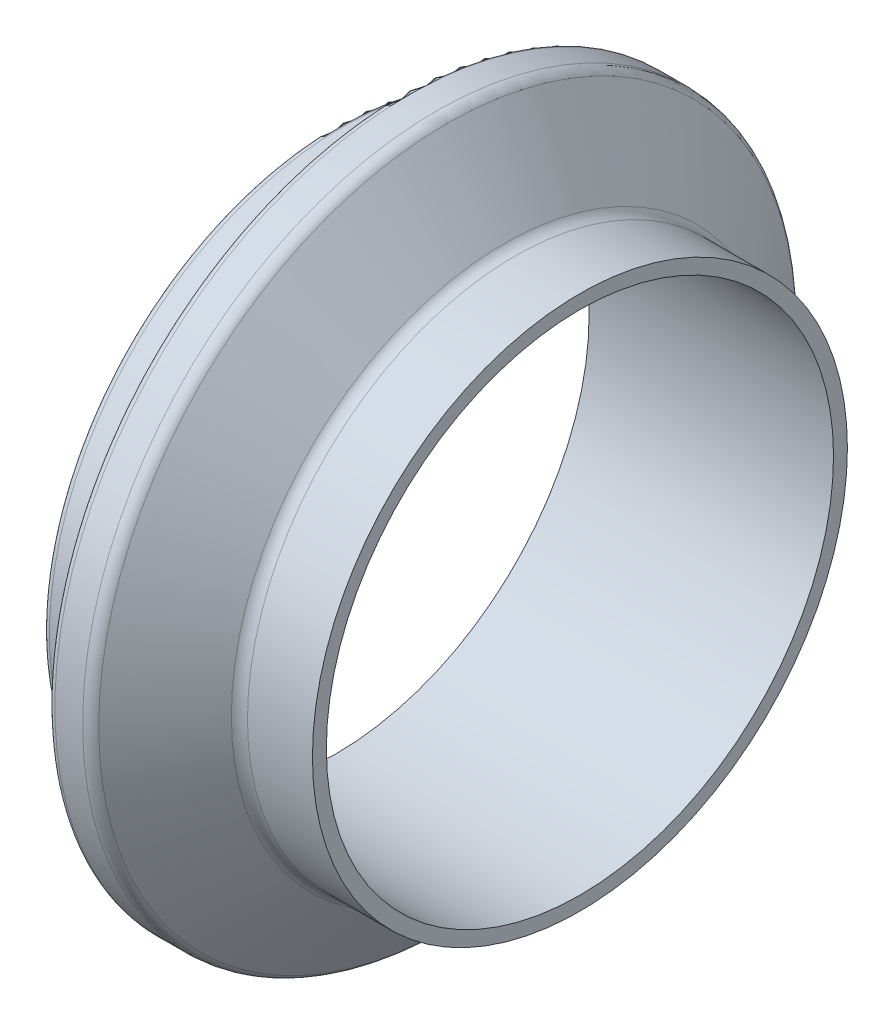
ISO-10303-21;
HEADER;
FILE_DESCRIPTION(('STEP AP214'),'2;1');
FILE_NAME('part.step','',(''),(''),'','','');
FILE_SCHEMA(('AUTOMOTIVE_DESIGN { 1 0 10303 214 1 1 1 1 }'));
ENDSEC;
DATA;
#1=APPLICATION_CONTEXT('core data for automotive mechanical design processes');
#2=APPLICATION_PROTOCOL_DEFINITION('international standard','automotive_design',2000,#1);
#3=PRODUCT_CONTEXT('',#1,'mechanical');
#4=PRODUCT('Part','Part','',(#3));
#5=PRODUCT_RELATED_PRODUCT_CATEGORY('part','',(#4));
#6=PRODUCT_DEFINITION_FORMATION('','',#4);
#7=PRODUCT_DEFINITION_CONTEXT('part definition',#1,'design');
#8=PRODUCT_DEFINITION('design','',#6,#7);
#9=PRODUCT_DEFINITION_SHAPE('','',#8);
#10=(LENGTH_UNIT() NAMED_UNIT(*) SI_UNIT(.MILLI.,.METRE.));
#11=(NAMED_UNIT(*) PLANE_ANGLE_UNIT() SI_UNIT($,.RADIAN.));
#12=(NAMED_UNIT(*) SI_UNIT($,.STERADIAN.) SOLID_ANGLE_UNIT());
#13=UNCERTAINTY_MEASURE_WITH_UNIT(LENGTH_MEASURE(1.E-05),#10,'distance_accuracy_value','');
#14=(GEOMETRIC_REPRESENTATION_CONTEXT(3) GLOBAL_UNCERTAINTY_ASSIGNED_CONTEXT((#13)) GLOBAL_UNIT_ASSIGNED_CONTEXT((#10,
#11,#12)) REPRESENTATION_CONTEXT('',''));
#15=CARTESIAN_POINT('',(0.,0.,0.));
#16=DIRECTION('',(0.,0.,1.));
#17=DIRECTION('',(1.,0.,0.));
#18=AXIS2_PLACEMENT_3D('',#15,#16,#17);
#19=CARTESIAN_POINT('',(0.,31.75,0.));
#20=DIRECTION('',(1.,0.,0.));
#21=DIRECTION('',(0.,0.,-1.));
#22=AXIS2_PLACEMENT_3D('',#19,#20,#21);
#23=PLANE('',#22);
#24=CARTESIAN_POINT('',(0.,0.,0.));
#25=DIRECTION('',(1.,0.,0.));
#26=DIRECTION('',(0.,0.,-1.));
#27=AXIS2_PLACEMENT_3D('',#24,#25,#26);
#28=CIRCLE('',#27,31.75);
#29=CARTESIAN_POINT('',(0.,0.,-31.75));
#30=VERTEX_POINT('',#29);
#31=EDGE_CURVE('E12',#30,#30,#28,.T.);
#32=ORIENTED_EDGE('',*,*,#31,.T.);
#33=EDGE_LOOP('',(#32));
#34=FACE_BOUND('',#33,.T.);
#35=CARTESIAN_POINT('',(0.,0.,0.));
#36=DIRECTION('',(1.,0.,0.));
#37=DIRECTION('',(0.,0.,-1.));
#38=AXIS2_PLACEMENT_3D('',#35,#36,#37);
#39=CIRCLE('',#38,30.099);
#40=CARTESIAN_POINT('',(0.,0.,-30.099));
#41=VERTEX_POINT('',#40);
#42=EDGE_CURVE('E81',#41,#41,#39,.T.);
#43=ORIENTED_EDGE('',*,*,#42,.F.);
#44=EDGE_LOOP('',(#43));
#45=FACE_BOUND('',#44,.T.);
#46=ADVANCED_FACE('F38',(#34,#45),#23,.T.);
#47=CARTESIAN_POINT('',(0.,0.,0.));
#48=DIRECTION('',(1.,0.,0.));
#49=DIRECTION('',(0.,0.,-1.));
#50=AXIS2_PLACEMENT_3D('',#47,#48,#49);
#51=CYLINDRICAL_SURFACE('',#50,31.75);
#52=CARTESIAN_POINT('',(-7.70966960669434,0.,0.));
#53=DIRECTION('',(1.,0.,0.));
#54=DIRECTION('',(0.,0.,-1.));
#55=AXIS2_PLACEMENT_3D('',#52,#53,#54);
#56=CIRCLE('',#55,31.75);
#57=CARTESIAN_POINT('',(-7.70966960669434,0.,-31.75));
#58=VERTEX_POINT('',#57);
#59=EDGE_CURVE('E44',#58,#58,#56,.T.);
#60=ORIENTED_EDGE('',*,*,#59,.T.);
#61=EDGE_LOOP('',(#60));
#62=FACE_BOUND('',#61,.T.);
#63=ORIENTED_EDGE('',*,*,#31,.F.);
#64=EDGE_LOOP('',(#63));
#65=FACE_BOUND('',#64,.T.);
#66=ADVANCED_FACE('F89',(#62,#65),#51,.T.);
#67=CARTESIAN_POINT('',(-7.70966960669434,0.,0.));
#68=DIRECTION('',(1.,0.,0.));
#69=DIRECTION('',(0.,0.,-1.));
#70=AXIS2_PLACEMENT_3D('',#67,#68,#69);
#71=TOROIDAL_SURFACE('',#70,33.3502,1.60020000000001);
#72=CARTESIAN_POINT('',(-8.98764614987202,0.,0.));
#73=DIRECTION('',(1.,0.,0.));
#74=DIRECTION('',(0.,0.,-1.));
#75=AXIS2_PLACEMENT_3D('',#72,#73,#74);
#76=CIRCLE('',#75,32.3871755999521);
#77=CARTESIAN_POINT('',(-8.98764614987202,0.,-32.3871755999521));
#78=VERTEX_POINT('',#77);
#79=EDGE_CURVE('E48',#78,#78,#76,.T.);
#80=ORIENTED_EDGE('',*,*,#79,.T.);
#81=EDGE_LOOP('',(#80));
#82=FACE_BOUND('',#81,.T.);
#83=ORIENTED_EDGE('',*,*,#59,.F.);
#84=EDGE_LOOP('',(#83));
#85=FACE_BOUND('',#84,.T.);
#86=ADVANCED_FACE('F93',(#82,#85),#71,.F.);
#87=CARTESIAN_POINT('',(-8.98764614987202,0.,0.));
#88=DIRECTION('',(-1.,0.,0.));
#89=DIRECTION('',(0.,0.,1.));
#90=AXIS2_PLACEMENT_3D('',#87,#88,#89);
#91=CONICAL_SURFACE('',#90,32.3871755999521,0.925024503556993);
#92=CARTESIAN_POINT('',(-15.7504537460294,0.,0.));
#93=DIRECTION('',(1.,0.,0.));
#94=DIRECTION('',(0.,0.,-1.));
#95=AXIS2_PLACEMENT_3D('',#92,#93,#94);
#96=CIRCLE('',#95,41.3617244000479);
#97=CARTESIAN_POINT('',(-15.7504537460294,0.,-41.3617244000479));
#98=VERTEX_POINT('',#97);
#99=EDGE_CURVE('E52',#98,#98,#96,.T.);
#100=ORIENTED_EDGE('',*,*,#99,.T.);
#101=EDGE_LOOP('',(#100));
#102=FACE_BOUND('',#101,.T.);
#103=ORIENTED_EDGE('',*,*,#79,.F.);
#104=EDGE_LOOP('',(#103));
#105=FACE_BOUND('',#104,.T.);
#106=ADVANCED_FACE('F97',(#102,#105),#91,.T.);
#107=CARTESIAN_POINT('',(-17.0284302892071,0.,0.));
#108=DIRECTION('',(1.,0.,0.));
#109=DIRECTION('',(0.,0.,-1.));
#110=AXIS2_PLACEMENT_3D('',#107,#108,#109);
#111=TOROIDAL_SURFACE('',#110,40.3987,1.6002);
#112=CARTESIAN_POINT('',(-17.0284302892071,0.,0.));
#113=DIRECTION('',(1.,0.,0.));
#114=DIRECTION('',(0.,0.,-1.));
#115=AXIS2_PLACEMENT_3D('',#112,#113,#114);
#116=CIRCLE('',#115,41.9989);
#117=CARTESIAN_POINT('',(-17.0284302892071,0.,-41.9989));
#118=VERTEX_POINT('',#117);
#119=EDGE_CURVE('E57',#118,#118,#116,.T.);
#120=ORIENTED_EDGE('',*,*,#119,.T.);
#121=EDGE_LOOP('',(#120));
#122=FACE_BOUND('',#121,.T.);
#123=ORIENTED_EDGE('',*,*,#99,.F.);
#124=EDGE_LOOP('',(#123));
#125=FACE_BOUND('',#124,.T.);
#126=ADVANCED_FACE('F104',(#122,#125),#111,.T.);
#127=CARTESIAN_POINT('',(0.,0.,0.));
#128=DIRECTION('',(1.,0.,0.));
#129=DIRECTION('',(0.,0.,-1.));
#130=AXIS2_PLACEMENT_3D('',#127,#128,#129);
#131=CYLINDRICAL_SURFACE('',#130,41.9989);
#132=CARTESIAN_POINT('',(-20.32,0.,0.));
#133=DIRECTION('',(1.,0.,0.));
#134=DIRECTION('',(0.,0.,-1.));
#135=AXIS2_PLACEMENT_3D('',#132,#133,#134);
#136=CIRCLE('',#135,41.9989);
#137=CARTESIAN_POINT('',(-20.32,0.,-41.9989));
#138=VERTEX_POINT('',#137);
#139=EDGE_CURVE('E60',#138,#138,#136,.T.);
#140=ORIENTED_EDGE('',*,*,#139,.T.);
#141=EDGE_LOOP('',(#140));
#142=FACE_BOUND('',#141,.T.);
#143=ORIENTED_EDGE('',*,*,#119,.F.);
#144=EDGE_LOOP('',(#143));
#145=FACE_BOUND('',#144,.T.);
#146=ADVANCED_FACE('F108',(#142,#145),#131,.T.);
#147=CARTESIAN_POINT('',(-20.32,0.,0.));
#148=DIRECTION('',(1.,0.,0.));
#149=DIRECTION('',(0.,0.,-1.));
#150=AXIS2_PLACEMENT_3D('',#147,#148,#149);
#151=TOROIDAL_SURFACE('',#150,41.1861,0.812800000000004);
#152=CARTESIAN_POINT('',(-21.1328,0.,0.));
#153=DIRECTION('',(1.,0.,0.));
#154=DIRECTION('',(0.,0.,-1.));
#155=AXIS2_PLACEMENT_3D('',#152,#153,#154);
#156=CIRCLE('',#155,41.1861);
#157=CARTESIAN_POINT('',(-21.1328,0.,-41.1861));
#158=VERTEX_POINT('',#157);
#159=EDGE_CURVE('E63',#158,#158,#156,.T.);
#160=ORIENTED_EDGE('',*,*,#159,.T.);
#161=EDGE_LOOP('',(#160));
#162=FACE_BOUND('',#161,.T.);
#163=ORIENTED_EDGE('',*,*,#139,.F.);
#164=EDGE_LOOP('',(#163));
#165=FACE_BOUND('',#164,.T.);
#166=ADVANCED_FACE('F112',(#162,#165),#151,.T.);
#167=CARTESIAN_POINT('',(-21.1328,35.5854,0.));
#168=DIRECTION('',(-1.,0.,0.));
#169=DIRECTION('',(0.,0.,1.));
#170=AXIS2_PLACEMENT_3D('',#167,#168,#169);
#171=PLANE('',#170);
#172=CARTESIAN_POINT('',(-21.1328,0.,0.));
#173=DIRECTION('',(1.,0.,0.));
#174=DIRECTION('',(0.,0.,-1.));
#175=AXIS2_PLACEMENT_3D('',#172,#173,#174);
#176=CIRCLE('',#175,35.5854);
#177=CARTESIAN_POINT('',(-21.1328,0.,-35.5854));
#178=VERTEX_POINT('',#177);
#179=EDGE_CURVE('E66',#178,#178,#176,.T.);
#180=ORIENTED_EDGE('',*,*,#179,.T.);
#181=EDGE_LOOP('',(#180));
#182=FACE_BOUND('',#181,.T.);
#183=ORIENTED_EDGE('',*,*,#159,.F.);
#184=EDGE_LOOP('',(#183));
#185=FACE_BOUND('',#184,.T.);
#186=ADVANCED_FACE('F116',(#182,#185),#171,.T.);
#187=CARTESIAN_POINT('',(-21.9456,0.,0.));
#188=DIRECTION('',(1.,0.,0.));
#189=DIRECTION('',(0.,0.,-1.));
#190=AXIS2_PLACEMENT_3D('',#187,#188,#189);
#191=TOROIDAL_SURFACE('',#190,35.5854,0.812799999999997);
#192=CARTESIAN_POINT('',(-21.9456,0.,0.));
#193=DIRECTION('',(1.,0.,0.));
#194=DIRECTION('',(0.,0.,-1.));
#195=AXIS2_PLACEMENT_3D('',#192,#193,#194);
#196=CIRCLE('',#195,34.7726);
#197=CARTESIAN_POINT('',(-21.9456,0.,-34.7726));
#198=VERTEX_POINT('',#197);
#199=EDGE_CURVE('E69',#198,#198,#196,.T.);
#200=ORIENTED_EDGE('',*,*,#199,.T.);
#201=EDGE_LOOP('',(#200));
#202=FACE_BOUND('',#201,.T.);
#203=ORIENTED_EDGE('',*,*,#179,.F.);
#204=EDGE_LOOP('',(#203));
#205=FACE_BOUND('',#204,.T.);
#206=ADVANCED_FACE('F120',(#202,#205),#191,.F.);
#207=CARTESIAN_POINT('',(0.,0.,0.));
#208=DIRECTION('',(1.,0.,0.));
#209=DIRECTION('',(0.,0.,-1.));
#210=AXIS2_PLACEMENT_3D('',#207,#208,#209);
#211=CYLINDRICAL_SURFACE('',#210,34.7726);
#212=CARTESIAN_POINT('',(-28.194,0.,0.));
#213=DIRECTION('',(1.,0.,0.));
#214=DIRECTION('',(0.,0.,-1.));
#215=AXIS2_PLACEMENT_3D('',#212,#213,#214);
#216=CIRCLE('',#215,34.7726);
#217=CARTESIAN_POINT('',(-28.194,0.,-34.7726));
#218=VERTEX_POINT('',#217);
#219=EDGE_CURVE('E72',#218,#218,#216,.T.);
#220=ORIENTED_EDGE('',*,*,#219,.T.);
#221=EDGE_LOOP('',(#220));
#222=FACE_BOUND('',#221,.T.);
#223=ORIENTED_EDGE('',*,*,#199,.F.);
#224=EDGE_LOOP('',(#223));
#225=FACE_BOUND('',#224,.T.);
#226=ADVANCED_FACE('F124',(#222,#225),#211,.T.);
#227=CARTESIAN_POINT('',(-28.194,0.,0.));
#228=DIRECTION('',(1.,0.,0.));
#229=DIRECTION('',(0.,0.,-1.));
#230=AXIS2_PLACEMENT_3D('',#227,#228,#229);
#231=TOROIDAL_SURFACE('',#230,33.9598,0.812799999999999);
#232=CARTESIAN_POINT('',(-29.0068,0.,0.));
#233=DIRECTION('',(1.,0.,0.));
#234=DIRECTION('',(0.,0.,-1.));
#235=AXIS2_PLACEMENT_3D('',#232,#233,#234);
#236=CIRCLE('',#235,33.9598);
#237=CARTESIAN_POINT('',(-29.0068,0.,-33.9598));
#238=VERTEX_POINT('',#237);
#239=EDGE_CURVE('E75',#238,#238,#236,.T.);
#240=ORIENTED_EDGE('',*,*,#239,.T.);
#241=EDGE_LOOP('',(#240));
#242=FACE_BOUND('',#241,.T.);
#243=ORIENTED_EDGE('',*,*,#219,.F.);
#244=EDGE_LOOP('',(#243));
#245=FACE_BOUND('',#244,.T.);
#246=ADVANCED_FACE('F128',(#242,#245),#231,.T.);
#247=CARTESIAN_POINT('',(-29.0068,30.099,0.));
#248=DIRECTION('',(-1.,0.,0.));
#249=DIRECTION('',(0.,0.,1.));
#250=AXIS2_PLACEMENT_3D('',#247,#248,#249);
#251=PLANE('',#250);
#252=CARTESIAN_POINT('',(-29.0068,0.,0.));
#253=DIRECTION('',(1.,0.,0.));
#254=DIRECTION('',(0.,0.,-1.));
#255=AXIS2_PLACEMENT_3D('',#252,#253,#254);
#256=CIRCLE('',#255,30.099);
#257=CARTESIAN_POINT('',(-29.0068,0.,-30.099));
#258=VERTEX_POINT('',#257);
#259=EDGE_CURVE('E78',#258,#258,#256,.T.);
#260=ORIENTED_EDGE('',*,*,#259,.T.);
#261=EDGE_LOOP('',(#260));
#262=FACE_BOUND('',#261,.T.);
#263=ORIENTED_EDGE('',*,*,#239,.F.);
#264=EDGE_LOOP('',(#263));
#265=FACE_BOUND('',#264,.T.);
#266=ADVANCED_FACE('F132',(#262,#265),#251,.T.);
#267=CARTESIAN_POINT('',(0.,0.,0.));
#268=DIRECTION('',(1.,0.,0.));
#269=DIRECTION('',(0.,0.,-1.));
#270=AXIS2_PLACEMENT_3D('',#267,#268,#269);
#271=CYLINDRICAL_SURFACE('',#270,30.099);
#272=ORIENTED_EDGE('',*,*,#42,.T.);
#273=EDGE_LOOP('',(#272));
#274=FACE_BOUND('',#273,.T.);
#275=ORIENTED_EDGE('',*,*,#259,.F.);
#276=EDGE_LOOP('',(#275));
#277=FACE_BOUND('',#276,.T.);
#278=ADVANCED_FACE('F85',(#274,#277),#271,.F.);
#279=CLOSED_SHELL('',(#46,#66,#86,#106,#126,#146,#166,#186,#206,#226,#246,#266,#278));
#280=MANIFOLD_SOLID_BREP('B2',#279);
#281=ADVANCED_BREP_SHAPE_REPRESENTATION('',(#18,#280),#14);
#282=SHAPE_DEFINITION_REPRESENTATION(#9,#281);
ENDSEC;
END-ISO-10303-21;
